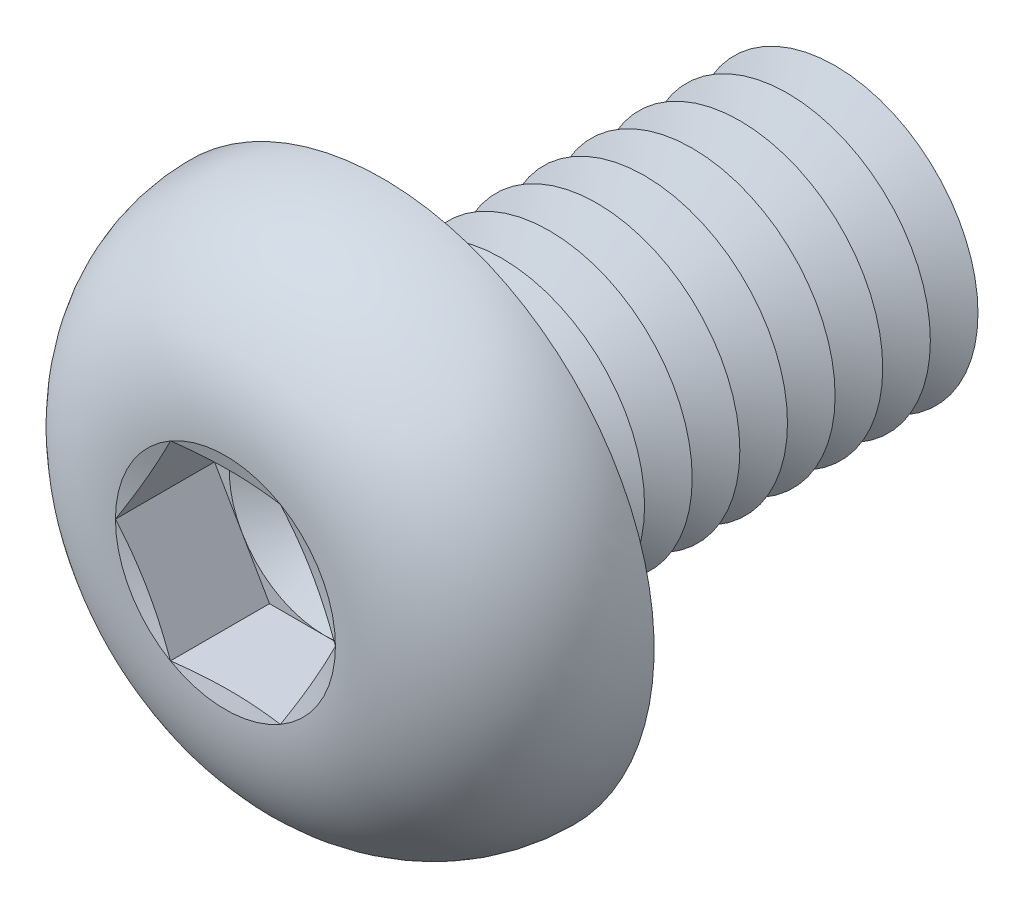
ISO-10303-21;
HEADER;
FILE_DESCRIPTION(('STEP AP214'),'2;1');
FILE_NAME('part.step','',(''),(''),'','','');
FILE_SCHEMA(('AUTOMOTIVE_DESIGN { 1 0 10303 214 1 1 1 1 }'));
ENDSEC;
DATA;
#1=APPLICATION_CONTEXT('core data for automotive mechanical design processes');
#2=APPLICATION_PROTOCOL_DEFINITION('international standard','automotive_design',2000,#1);
#3=PRODUCT_CONTEXT('',#1,'mechanical');
#4=PRODUCT('Part','Part','',(#3));
#5=PRODUCT_RELATED_PRODUCT_CATEGORY('part','',(#4));
#6=PRODUCT_DEFINITION_FORMATION('','',#4);
#7=PRODUCT_DEFINITION_CONTEXT('part definition',#1,'design');
#8=PRODUCT_DEFINITION('design','',#6,#7);
#9=PRODUCT_DEFINITION_SHAPE('','',#8);
#10=(LENGTH_UNIT() NAMED_UNIT(*) SI_UNIT(.MILLI.,.METRE.));
#11=(NAMED_UNIT(*) PLANE_ANGLE_UNIT() SI_UNIT($,.RADIAN.));
#12=(NAMED_UNIT(*) SI_UNIT($,.STERADIAN.) SOLID_ANGLE_UNIT());
#13=UNCERTAINTY_MEASURE_WITH_UNIT(LENGTH_MEASURE(1.E-05),#10,'distance_accuracy_value','');
#14=(GEOMETRIC_REPRESENTATION_CONTEXT(3) GLOBAL_UNCERTAINTY_ASSIGNED_CONTEXT((#13)) GLOBAL_UNIT_ASSIGNED_CONTEXT((#10,
#11,#12)) REPRESENTATION_CONTEXT('',''));
#15=CARTESIAN_POINT('',(0.,0.,0.));
#16=DIRECTION('',(0.,0.,1.));
#17=DIRECTION('',(1.,0.,0.));
#18=AXIS2_PLACEMENT_3D('',#15,#16,#17);
#19=CARTESIAN_POINT('',(0.,0.,0.609999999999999));
#20=DIRECTION('',(0.,0.,1.));
#21=DIRECTION('',(1.,0.,0.));
#22=AXIS2_PLACEMENT_3D('',#19,#20,#21);
#23=PLANE('',#22);
#24=CARTESIAN_POINT('',(0.,0.,0.609999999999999));
#25=DIRECTION('',(0.,0.,1.));
#26=DIRECTION('',(1.,0.,0.));
#27=AXIS2_PLACEMENT_3D('',#24,#25,#26);
#28=CIRCLE('',#27,0.999999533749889);
#29=CARTESIAN_POINT('',(0.866024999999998,0.499999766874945,0.609999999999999));
#30=VERTEX_POINT('',#29);
#31=CARTESIAN_POINT('',(0.,0.999999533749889,0.609999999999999));
#32=VERTEX_POINT('',#31);
#33=EDGE_CURVE('E118',#30,#32,#28,.T.);
#34=ORIENTED_EDGE('',*,*,#33,.F.);
#35=DIRECTION('',(-0.500000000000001,0.866025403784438,0.));
#36=VECTOR('',#35,1.);
#37=CARTESIAN_POINT('',(1.1547,0.,0.609999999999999));
#38=LINE('',#37,#36);
#39=CARTESIAN_POINT('',(0.577349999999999,0.999999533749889,0.609999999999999));
#40=VERTEX_POINT('',#39);
#41=EDGE_CURVE('E125',#30,#40,#38,.T.);
#42=ORIENTED_EDGE('',*,*,#41,.T.);
#43=DIRECTION('',(-1.,0.,0.));
#44=VECTOR('',#43,1.);
#45=CARTESIAN_POINT('',(0.577349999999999,0.999999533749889,0.609999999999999));
#46=LINE('',#45,#44);
#47=EDGE_CURVE('E136',#40,#32,#46,.T.);
#48=ORIENTED_EDGE('',*,*,#47,.T.);
#49=EDGE_LOOP('',(#34,#42,#48));
#50=FACE_BOUND('',#49,.T.);
#51=ADVANCED_FACE('F39',(#50),#23,.T.);
#52=CARTESIAN_POINT('',(0.,0.,0.609999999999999));
#53=DIRECTION('',(0.,0.,1.));
#54=DIRECTION('',(1.,0.,0.));
#55=AXIS2_PLACEMENT_3D('',#52,#53,#54);
#56=CIRCLE('',#55,0.999999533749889);
#57=CARTESIAN_POINT('',(-0.866024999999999,0.499999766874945,0.609999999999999));
#58=VERTEX_POINT('',#57);
#59=EDGE_CURVE('E11',#32,#58,#56,.T.);
#60=ORIENTED_EDGE('',*,*,#59,.F.);
#61=CARTESIAN_POINT('',(-0.577350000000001,0.999999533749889,0.609999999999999));
#62=VERTEX_POINT('',#61);
#63=EDGE_CURVE('E131',#32,#62,#46,.T.);
#64=ORIENTED_EDGE('',*,*,#63,.T.);
#65=DIRECTION('',(-0.5,-0.866025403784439,0.));
#66=VECTOR('',#65,1.);
#67=CARTESIAN_POINT('',(-0.577350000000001,0.999999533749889,0.609999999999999));
#68=LINE('',#67,#66);
#69=EDGE_CURVE('E134',#62,#58,#68,.T.);
#70=ORIENTED_EDGE('',*,*,#69,.T.);
#71=EDGE_LOOP('',(#60,#64,#70));
#72=FACE_BOUND('',#71,.T.);
#73=ADVANCED_FACE('F130',(#72),#23,.T.);
#74=CARTESIAN_POINT('',(-0.866024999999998,-0.499999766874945,0.609999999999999));
#75=VERTEX_POINT('',#74);
#76=EDGE_CURVE('E49',#58,#75,#56,.T.);
#77=ORIENTED_EDGE('',*,*,#76,.F.);
#78=CARTESIAN_POINT('',(-1.1547,0.,0.609999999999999));
#79=VERTEX_POINT('',#78);
#80=EDGE_CURVE('E143',#58,#79,#68,.T.);
#81=ORIENTED_EDGE('',*,*,#80,.T.);
#82=DIRECTION('',(0.5,-0.866025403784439,0.));
#83=VECTOR('',#82,1.);
#84=CARTESIAN_POINT('',(-1.1547,0.,0.609999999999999));
#85=LINE('',#84,#83);
#86=EDGE_CURVE('E152',#79,#75,#85,.T.);
#87=ORIENTED_EDGE('',*,*,#86,.T.);
#88=EDGE_LOOP('',(#77,#81,#87));
#89=FACE_BOUND('',#88,.T.);
#90=ADVANCED_FACE('F347',(#89),#23,.T.);
#91=CARTESIAN_POINT('',(0.,-0.999999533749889,0.609999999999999));
#92=VERTEX_POINT('',#91);
#93=EDGE_CURVE('E332',#75,#92,#56,.T.);
#94=ORIENTED_EDGE('',*,*,#93,.F.);
#95=CARTESIAN_POINT('',(-0.577349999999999,-0.99999953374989,0.609999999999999));
#96=VERTEX_POINT('',#95);
#97=EDGE_CURVE('E151',#75,#96,#85,.T.);
#98=ORIENTED_EDGE('',*,*,#97,.T.);
#99=DIRECTION('',(1.,0.,0.));
#100=VECTOR('',#99,1.);
#101=CARTESIAN_POINT('',(-0.577349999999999,-0.99999953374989,0.609999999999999));
#102=LINE('',#101,#100);
#103=EDGE_CURVE('E157',#96,#92,#102,.T.);
#104=ORIENTED_EDGE('',*,*,#103,.T.);
#105=EDGE_LOOP('',(#94,#98,#104));
#106=FACE_BOUND('',#105,.T.);
#107=ADVANCED_FACE('F340',(#106),#23,.T.);
#108=CARTESIAN_POINT('',(0.866024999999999,-0.499999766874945,0.609999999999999));
#109=VERTEX_POINT('',#108);
#110=EDGE_CURVE('E56',#92,#109,#56,.T.);
#111=ORIENTED_EDGE('',*,*,#110,.F.);
#112=CARTESIAN_POINT('',(0.577349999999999,-0.99999953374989,0.609999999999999));
#113=VERTEX_POINT('',#112);
#114=EDGE_CURVE('E156',#92,#113,#102,.T.);
#115=ORIENTED_EDGE('',*,*,#114,.T.);
#116=DIRECTION('',(0.5,0.866025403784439,0.));
#117=VECTOR('',#116,1.);
#118=CARTESIAN_POINT('',(0.577349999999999,-0.99999953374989,0.609999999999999));
#119=LINE('',#118,#117);
#120=EDGE_CURVE('E162',#113,#109,#119,.T.);
#121=ORIENTED_EDGE('',*,*,#120,.T.);
#122=EDGE_LOOP('',(#111,#115,#121));
#123=FACE_BOUND('',#122,.T.);
#124=ADVANCED_FACE('F389',(#123),#23,.T.);
#125=CARTESIAN_POINT('',(0.,0.,1.65));
#126=DIRECTION('',(0.,0.,1.));
#127=DIRECTION('',(1.,0.,0.));
#128=AXIS2_PLACEMENT_3D('',#125,#126,#127);
#129=CONICAL_SURFACE('',#128,1.1547,1.30899693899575);
#130=CARTESIAN_POINT('',(1.15481547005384,-0.000199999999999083,1.65003094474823));
#131=CARTESIAN_POINT('',(1.13083002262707,0.0413440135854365,1.64359970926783));
#132=CARTESIAN_POINT('',(1.10680107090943,0.0829633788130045,1.63776108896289));
#133=CARTESIAN_POINT('',(1.05865826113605,0.166349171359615,1.62750303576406));
#134=CARTESIAN_POINT('',(1.03454437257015,0.208115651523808,1.62308418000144));
#135=CARTESIAN_POINT('',(0.986377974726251,0.291542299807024,1.61592375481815));
#136=CARTESIAN_POINT('',(0.962325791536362,0.333201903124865,1.61317364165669));
#137=CARTESIAN_POINT('',(0.914190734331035,0.416574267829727,1.60948600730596));
#138=CARTESIAN_POINT('',(0.890107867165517,0.458287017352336,1.60854813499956));
#139=CARTESIAN_POINT('',(0.841942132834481,0.541712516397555,1.60854813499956));
#140=CARTESIAN_POINT('',(0.817859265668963,0.583425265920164,1.60948600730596));
#141=CARTESIAN_POINT('',(0.769724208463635,0.666797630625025,1.61317364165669));
#142=CARTESIAN_POINT('',(0.745672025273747,0.708457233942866,1.61592375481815));
#143=CARTESIAN_POINT('',(0.697505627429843,0.791883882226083,1.62308418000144));
#144=CARTESIAN_POINT('',(0.673391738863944,0.833650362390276,1.62750303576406));
#145=CARTESIAN_POINT('',(0.625248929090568,0.917036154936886,1.63776108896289));
#146=CARTESIAN_POINT('',(0.60121997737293,0.958655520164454,1.64359970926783));
#147=CARTESIAN_POINT('',(0.577234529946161,1.00019953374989,1.65003094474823));
#148=B_SPLINE_CURVE_WITH_KNOTS('',3,(#130,#131,#132,#133,#134,#135,#136,#137,#138,#139,#140,
#141,#142,#143,#144,#145,#146,#147),.UNSPECIFIED.,.F.,.F.,(4,2,2,2,2,2,2,2,4),(0.,
0.145207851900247,0.290474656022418,0.434991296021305,0.579479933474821,0.723968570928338,
0.868485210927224,1.0137520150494,1.15895986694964),.UNSPECIFIED.);
#149=CARTESIAN_POINT('',(1.1547,0.,1.65));
#150=VERTEX_POINT('',#149);
#151=CARTESIAN_POINT('',(0.57735,0.99999953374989,1.65));
#152=VERTEX_POINT('',#151);
#153=EDGE_CURVE('E221',#150,#152,#148,.T.);
#154=ORIENTED_EDGE('',*,*,#153,.F.);
#155=CARTESIAN_POINT('',(0.,0.,1.65));
#156=DIRECTION('',(0.,0.,-1.));
#157=DIRECTION('',(-1.,0.,0.));
#158=AXIS2_PLACEMENT_3D('',#155,#156,#157);
#159=CIRCLE('',#158,1.1547);
#160=EDGE_CURVE('E377',#152,#150,#159,.T.);
#161=ORIENTED_EDGE('',*,*,#160,.F.);
#162=EDGE_LOOP('',(#154,#161));
#163=FACE_BOUND('',#162,.T.);
#164=ADVANCED_FACE('F405',(#163),#129,.F.);
#165=CARTESIAN_POINT('',(0.577234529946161,-1.00019953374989,1.65003094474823));
#166=CARTESIAN_POINT('',(0.60121997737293,-0.958655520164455,1.64359970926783));
#167=CARTESIAN_POINT('',(0.625248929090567,-0.917036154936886,1.63776108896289));
#168=CARTESIAN_POINT('',(0.673391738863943,-0.833650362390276,1.62750303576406));
#169=CARTESIAN_POINT('',(0.697505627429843,-0.791883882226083,1.62308418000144));
#170=CARTESIAN_POINT('',(0.745672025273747,-0.708457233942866,1.61592375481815));
#171=CARTESIAN_POINT('',(0.769724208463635,-0.666797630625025,1.61317364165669));
#172=CARTESIAN_POINT('',(0.817859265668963,-0.583425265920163,1.60948600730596));
#173=CARTESIAN_POINT('',(0.841942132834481,-0.541712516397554,1.60854813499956));
#174=CARTESIAN_POINT('',(0.890107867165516,-0.458287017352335,1.60854813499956));
#175=CARTESIAN_POINT('',(0.914190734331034,-0.416574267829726,1.60948600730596));
#176=CARTESIAN_POINT('',(0.962325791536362,-0.333201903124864,1.61317364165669));
#177=CARTESIAN_POINT('',(0.986377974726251,-0.291542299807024,1.61592375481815));
#178=CARTESIAN_POINT('',(1.03454437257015,-0.208115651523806,1.62308418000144));
#179=CARTESIAN_POINT('',(1.05865826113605,-0.166349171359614,1.62750303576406));
#180=CARTESIAN_POINT('',(1.10680107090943,-0.0829633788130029,1.63776108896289));
#181=CARTESIAN_POINT('',(1.13083002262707,-0.0413440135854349,1.64359970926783));
#182=CARTESIAN_POINT('',(1.15481547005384,0.00020000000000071,1.65003094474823));
#183=B_SPLINE_CURVE_WITH_KNOTS('',3,(#165,#166,#167,#168,#169,#170,#171,#172,#173,#174,#175,
#176,#177,#178,#179,#180,#181,#182),.UNSPECIFIED.,.F.,.F.,(4,2,2,2,2,2,2,2,4),(0.,
0.145207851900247,0.290474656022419,0.434991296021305,0.579479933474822,0.723968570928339,
0.868485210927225,1.0137520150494,1.15895986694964),.UNSPECIFIED.);
#184=CARTESIAN_POINT('',(0.577349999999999,-0.99999953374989,1.65));
#185=VERTEX_POINT('',#184);
#186=EDGE_CURVE('E230',#185,#150,#183,.T.);
#187=ORIENTED_EDGE('',*,*,#186,.F.);
#188=EDGE_CURVE('E379',#150,#185,#159,.T.);
#189=ORIENTED_EDGE('',*,*,#188,.F.);
#190=EDGE_LOOP('',(#187,#189));
#191=FACE_BOUND('',#190,.T.);
#192=ADVANCED_FACE('F407',(#191),#129,.F.);
#193=CARTESIAN_POINT('',(-1.7425668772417,-0.99999953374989,1.87893949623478));
#194=CARTESIAN_POINT('',(-1.65819693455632,-0.99999953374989,1.85935934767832));
#195=CARTESIAN_POINT('',(-1.57375647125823,-0.99999953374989,1.84006351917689));
#196=CARTESIAN_POINT('',(-1.40464514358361,-0.99999953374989,1.80242908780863));
#197=CARTESIAN_POINT('',(-1.31997423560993,-0.99999953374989,1.78409068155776));
#198=CARTESIAN_POINT('',(-1.14955192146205,-0.99999953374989,1.74860242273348));
#199=CARTESIAN_POINT('',(-1.06379782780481,-0.99999953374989,1.73146532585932));
#200=CARTESIAN_POINT('',(-0.891887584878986,-0.99999953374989,1.69925819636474));
#201=CARTESIAN_POINT('',(-0.805731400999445,-0.99999953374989,1.68418834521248));
#202=CARTESIAN_POINT('',(-0.635256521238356,-0.99999953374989,1.65751615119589));
#203=CARTESIAN_POINT('',(-0.550951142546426,-0.99999953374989,1.64583105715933));
#204=CARTESIAN_POINT('',(-0.381865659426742,-0.99999953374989,1.62668811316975));
#205=CARTESIAN_POINT('',(-0.297085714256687,-0.99999953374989,1.61922892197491));
#206=CARTESIAN_POINT('',(-0.127577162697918,-0.99999953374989,1.60981453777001));
#207=CARTESIAN_POINT('',(-0.0428499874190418,-0.99999953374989,1.60783514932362));
#208=CARTESIAN_POINT('',(0.126542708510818,-0.99999953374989,1.60973012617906));
#209=CARTESIAN_POINT('',(0.211208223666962,-0.99999953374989,1.61360496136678));
#210=CARTESIAN_POINT('',(0.356115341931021,-0.99999953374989,1.62460226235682));
#211=CARTESIAN_POINT('',(0.416458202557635,-0.99999953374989,1.63048841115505));
#212=CARTESIAN_POINT('',(0.536893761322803,-0.99999953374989,1.64437752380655));
#213=CARTESIAN_POINT('',(0.596986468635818,-0.99999953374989,1.65238040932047));
#214=CARTESIAN_POINT('',(0.777275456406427,-0.99999953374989,1.67888855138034));
#215=CARTESIAN_POINT('',(0.897104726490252,-0.99999953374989,1.69985858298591));
#216=CARTESIAN_POINT('',(1.07751611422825,-0.99999953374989,1.73433574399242));
#217=CARTESIAN_POINT('',(1.1383777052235,-0.99999953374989,1.74646914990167));
#218=CARTESIAN_POINT('',(1.25994955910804,-0.99999953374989,1.7714845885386));
#219=CARTESIAN_POINT('',(1.32065982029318,-0.99999953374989,1.7843666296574));
#220=CARTESIAN_POINT('',(1.44162663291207,-0.99999953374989,1.81062164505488));
#221=CARTESIAN_POINT('',(1.50188385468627,-0.99999953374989,1.82399156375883));
#222=CARTESIAN_POINT('',(1.62229550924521,-0.99999953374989,1.85116781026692));
#223=CARTESIAN_POINT('',(1.68244994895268,-0.99999953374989,1.86497410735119));
#224=CARTESIAN_POINT('',(1.7425668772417,-0.99999953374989,1.87893949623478));
#225=B_SPLINE_CURVE_WITH_KNOTS('',3,(#193,#194,#195,#196,#197,#198,#199,#200,#201,#202,#203,
#204,#205,#206,#207,#208,#209,#210,#211,#212,#213,#214,#215,#216,#217,#218,#219,#220,#221,#222,
#223,#224),.UNSPECIFIED.,.F.,.F.,(4,2,2,2,2,2,2,2,2,2,2,2,2,2,2,4),(0.,0.259842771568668,
0.519738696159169,0.782071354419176,1.04442702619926,1.29968778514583,1.55486748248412,
1.80891865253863,2.06299021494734,2.24483732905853,2.42667771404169,2.79149503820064,
2.97767344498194,3.16385393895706,3.34902052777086,3.53417411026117),.UNSPECIFIED.);
#226=CARTESIAN_POINT('',(-0.577349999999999,-0.99999953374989,1.65));
#227=VERTEX_POINT('',#226);
#228=EDGE_CURVE('E359',#227,#185,#225,.T.);
#229=ORIENTED_EDGE('',*,*,#228,.F.);
#230=EDGE_CURVE('E367',#185,#227,#159,.T.);
#231=ORIENTED_EDGE('',*,*,#230,.F.);
#232=EDGE_LOOP('',(#229,#231));
#233=FACE_BOUND('',#232,.T.);
#234=ADVANCED_FACE('F409',(#233),#129,.F.);
#235=CARTESIAN_POINT('',(-1.15481547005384,0.000200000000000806,1.65003094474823));
#236=CARTESIAN_POINT('',(-1.13083002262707,-0.0413440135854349,1.64359970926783));
#237=CARTESIAN_POINT('',(-1.10680107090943,-0.082963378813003,1.63776108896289));
#238=CARTESIAN_POINT('',(-1.05865826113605,-0.166349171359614,1.62750303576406));
#239=CARTESIAN_POINT('',(-1.03454437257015,-0.208115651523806,1.62308418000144));
#240=CARTESIAN_POINT('',(-0.986377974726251,-0.291542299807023,1.61592375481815));
#241=CARTESIAN_POINT('',(-0.962325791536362,-0.333201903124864,1.61317364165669));
#242=CARTESIAN_POINT('',(-0.914190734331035,-0.416574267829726,1.60948600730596));
#243=CARTESIAN_POINT('',(-0.890107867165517,-0.458287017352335,1.60854813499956));
#244=CARTESIAN_POINT('',(-0.841942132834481,-0.541712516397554,1.60854813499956));
#245=CARTESIAN_POINT('',(-0.817859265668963,-0.583425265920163,1.60948600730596));
#246=CARTESIAN_POINT('',(-0.769724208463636,-0.666797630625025,1.61317364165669));
#247=CARTESIAN_POINT('',(-0.745672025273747,-0.708457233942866,1.61592375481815));
#248=CARTESIAN_POINT('',(-0.697505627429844,-0.791883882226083,1.62308418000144));
#249=CARTESIAN_POINT('',(-0.673391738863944,-0.833650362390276,1.62750303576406));
#250=CARTESIAN_POINT('',(-0.625248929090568,-0.917036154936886,1.63776108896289));
#251=CARTESIAN_POINT('',(-0.60121997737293,-0.958655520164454,1.64359970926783));
#252=CARTESIAN_POINT('',(-0.577234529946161,-1.00019953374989,1.65003094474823));
#253=B_SPLINE_CURVE_WITH_KNOTS('',3,(#235,#236,#237,#238,#239,#240,#241,#242,#243,#244,#245,
#246,#247,#248,#249,#250,#251,#252),.UNSPECIFIED.,.F.,.F.,(4,2,2,2,2,2,2,2,4),(0.,
0.145207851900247,0.290474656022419,0.434991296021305,0.579479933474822,0.723968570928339,
0.868485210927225,1.0137520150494,1.15895986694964),.UNSPECIFIED.);
#254=CARTESIAN_POINT('',(-1.1547,0.,1.65));
#255=VERTEX_POINT('',#254);
#256=EDGE_CURVE('E352',#255,#227,#253,.T.);
#257=ORIENTED_EDGE('',*,*,#256,.F.);
#258=EDGE_CURVE('E315',#227,#255,#159,.T.);
#259=ORIENTED_EDGE('',*,*,#258,.F.);
#260=EDGE_LOOP('',(#257,#259));
#261=FACE_BOUND('',#260,.T.);
#262=ADVANCED_FACE('F356',(#261),#129,.F.);
#263=CARTESIAN_POINT('',(-0.577234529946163,1.00019953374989,1.65003094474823));
#264=CARTESIAN_POINT('',(-0.601219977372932,0.958655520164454,1.64359970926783));
#265=CARTESIAN_POINT('',(-0.625248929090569,0.917036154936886,1.63776108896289));
#266=CARTESIAN_POINT('',(-0.673391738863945,0.833650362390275,1.62750303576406));
#267=CARTESIAN_POINT('',(-0.697505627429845,0.791883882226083,1.62308418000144));
#268=CARTESIAN_POINT('',(-0.745672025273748,0.708457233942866,1.61592375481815));
#269=CARTESIAN_POINT('',(-0.769724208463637,0.666797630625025,1.61317364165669));
#270=CARTESIAN_POINT('',(-0.817859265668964,0.583425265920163,1.60948600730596));
#271=CARTESIAN_POINT('',(-0.841942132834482,0.541712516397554,1.60854813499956));
#272=CARTESIAN_POINT('',(-0.890107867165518,0.458287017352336,1.60854813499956));
#273=CARTESIAN_POINT('',(-0.914190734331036,0.416574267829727,1.60948600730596));
#274=CARTESIAN_POINT('',(-0.962325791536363,0.333201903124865,1.61317364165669));
#275=CARTESIAN_POINT('',(-0.986377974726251,0.291542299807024,1.61592375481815));
#276=CARTESIAN_POINT('',(-1.03454437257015,0.208115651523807,1.62308418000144));
#277=CARTESIAN_POINT('',(-1.05865826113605,0.166349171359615,1.62750303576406));
#278=CARTESIAN_POINT('',(-1.10680107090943,0.0829633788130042,1.63776108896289));
#279=CARTESIAN_POINT('',(-1.13083002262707,0.0413440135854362,1.64359970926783));
#280=CARTESIAN_POINT('',(-1.15481547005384,-0.000199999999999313,1.65003094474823));
#281=B_SPLINE_CURVE_WITH_KNOTS('',3,(#263,#264,#265,#266,#267,#268,#269,#270,#271,#272,#273,
#274,#275,#276,#277,#278,#279,#280),.UNSPECIFIED.,.F.,.F.,(4,2,2,2,2,2,2,2,4),(0.,
0.145207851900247,0.290474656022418,0.434991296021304,0.579479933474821,0.723968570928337,
0.868485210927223,1.01375201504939,1.15895986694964),.UNSPECIFIED.);
#282=CARTESIAN_POINT('',(-0.577350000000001,0.999999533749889,1.65));
#283=VERTEX_POINT('',#282);
#284=EDGE_CURVE('E195',#283,#255,#281,.T.);
#285=ORIENTED_EDGE('',*,*,#284,.F.);
#286=EDGE_CURVE('E316',#255,#283,#159,.T.);
#287=ORIENTED_EDGE('',*,*,#286,.F.);
#288=EDGE_LOOP('',(#285,#287));
#289=FACE_BOUND('',#288,.T.);
#290=ADVANCED_FACE('F370',(#289),#129,.F.);
#291=CARTESIAN_POINT('',(0.,0.,-3.25));
#292=DIRECTION('',(0.,0.,1.));
#293=DIRECTION('',(1.,0.,0.));
#294=AXIS2_PLACEMENT_3D('',#291,#292,#293);
#295=CONICAL_SURFACE('',#294,1.5,1.0471975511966);
#296=CARTESIAN_POINT('',(0.,0.,-3.5));
#297=DIRECTION('',(0.,0.,1.));
#298=DIRECTION('',(1.,0.,0.));
#299=AXIS2_PLACEMENT_3D('',#296,#297,#298);
#300=CIRCLE('',#299,1.06698729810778);
#301=CARTESIAN_POINT('',(1.06698729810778,0.,-3.5));
#302=VERTEX_POINT('',#301);
#303=EDGE_CURVE('E287',#302,#302,#300,.T.);
#304=ORIENTED_EDGE('',*,*,#303,.T.);
#305=EDGE_LOOP('',(#304));
#306=FACE_BOUND('',#305,.T.);
#307=CARTESIAN_POINT('',(0.,0.,-3.25));
#308=DIRECTION('',(0.,0.,1.));
#309=DIRECTION('',(1.,0.,0.));
#310=AXIS2_PLACEMENT_3D('',#307,#308,#309);
#311=CIRCLE('',#310,1.5);
#312=CARTESIAN_POINT('',(1.5,0.,-3.25));
#313=VERTEX_POINT('',#312);
#314=EDGE_CURVE('E283',#313,#313,#311,.T.);
#315=ORIENTED_EDGE('',*,*,#314,.F.);
#316=EDGE_LOOP('',(#315));
#317=FACE_BOUND('',#316,.T.);
#318=ADVANCED_FACE('F482',(#306,#317),#295,.T.);
#319=CARTESIAN_POINT('',(0.,0.,-3.5));
#320=DIRECTION('',(0.,0.,-1.));
#321=DIRECTION('',(-1.,0.,0.));
#322=AXIS2_PLACEMENT_3D('',#319,#320,#321);
#323=CONICAL_SURFACE('',#322,1.06698729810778,1.0471975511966);
#324=CARTESIAN_POINT('',(0.,0.,-3.75));
#325=DIRECTION('',(0.,0.,1.));
#326=DIRECTION('',(1.,0.,0.));
#327=AXIS2_PLACEMENT_3D('',#324,#325,#326);
#328=CIRCLE('',#327,1.5);
#329=CARTESIAN_POINT('',(1.5,0.,-3.75));
#330=VERTEX_POINT('',#329);
#331=EDGE_CURVE('E291',#330,#330,#328,.T.);
#332=ORIENTED_EDGE('',*,*,#331,.T.);
#333=EDGE_LOOP('',(#332));
#334=FACE_BOUND('',#333,.T.);
#335=ORIENTED_EDGE('',*,*,#303,.F.);
#336=EDGE_LOOP('',(#335));
#337=FACE_BOUND('',#336,.T.);
#338=ADVANCED_FACE('F673',(#334,#337),#323,.T.);
#339=CARTESIAN_POINT('',(0.,1.5,-5.));
#340=DIRECTION('',(0.,0.,-1.));
#341=DIRECTION('',(-1.,0.,0.));
#342=AXIS2_PLACEMENT_3D('',#339,#340,#341);
#343=PLANE('',#342);
#344=CARTESIAN_POINT('',(0.,0.,-5.));
#345=DIRECTION('',(0.,0.,1.));
#346=DIRECTION('',(1.,0.,0.));
#347=AXIS2_PLACEMENT_3D('',#344,#345,#346);
#348=CIRCLE('',#347,1.06698729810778);
#349=CARTESIAN_POINT('',(1.06698729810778,0.,-5.));
#350=VERTEX_POINT('',#349);
#351=EDGE_CURVE('E311',#350,#350,#348,.T.);
#352=ORIENTED_EDGE('',*,*,#351,.F.);
#353=EDGE_LOOP('',(#352));
#354=FACE_BOUND('',#353,.T.);
#355=ADVANCED_FACE('F678',(#354),#343,.T.);
#356=CARTESIAN_POINT('',(0.,0.,-4.75));
#357=DIRECTION('',(0.,0.,1.));
#358=DIRECTION('',(1.,0.,0.));
#359=AXIS2_PLACEMENT_3D('',#356,#357,#358);
#360=CONICAL_SURFACE('',#359,1.5,1.0471975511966);
#361=ORIENTED_EDGE('',*,*,#351,.T.);
#362=EDGE_LOOP('',(#361));
#363=FACE_BOUND('',#362,.T.);
#364=CARTESIAN_POINT('',(0.,0.,-4.75));
#365=DIRECTION('',(0.,0.,1.));
#366=DIRECTION('',(1.,0.,0.));
#367=AXIS2_PLACEMENT_3D('',#364,#365,#366);
#368=CIRCLE('',#367,1.5);
#369=CARTESIAN_POINT('',(1.5,0.,-4.75));
#370=VERTEX_POINT('',#369);
#371=EDGE_CURVE('E307',#370,#370,#368,.T.);
#372=ORIENTED_EDGE('',*,*,#371,.F.);
#373=EDGE_LOOP('',(#372));
#374=FACE_BOUND('',#373,.T.);
#375=ADVANCED_FACE('F666',(#363,#374),#360,.T.);
#376=CARTESIAN_POINT('',(0.,0.,-4.5));
#377=DIRECTION('',(0.,0.,-1.));
#378=DIRECTION('',(-1.,0.,0.));
#379=AXIS2_PLACEMENT_3D('',#376,#377,#378);
#380=CONICAL_SURFACE('',#379,1.06698729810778,1.0471975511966);
#381=ORIENTED_EDGE('',*,*,#371,.T.);
#382=EDGE_LOOP('',(#381));
#383=FACE_BOUND('',#382,.T.);
#384=CARTESIAN_POINT('',(0.,0.,-4.5));
#385=DIRECTION('',(0.,0.,1.));
#386=DIRECTION('',(1.,0.,0.));
#387=AXIS2_PLACEMENT_3D('',#384,#385,#386);
#388=CIRCLE('',#387,1.06698729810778);
#389=CARTESIAN_POINT('',(1.06698729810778,0.,-4.5));
#390=VERTEX_POINT('',#389);
#391=EDGE_CURVE('E303',#390,#390,#388,.T.);
#392=ORIENTED_EDGE('',*,*,#391,.F.);
#393=EDGE_LOOP('',(#392));
#394=FACE_BOUND('',#393,.T.);
#395=ADVANCED_FACE('F656',(#383,#394),#380,.T.);
#396=CARTESIAN_POINT('',(0.,0.,-4.25));
#397=DIRECTION('',(0.,0.,1.));
#398=DIRECTION('',(1.,0.,0.));
#399=AXIS2_PLACEMENT_3D('',#396,#397,#398);
#400=CONICAL_SURFACE('',#399,1.5,1.0471975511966);
#401=ORIENTED_EDGE('',*,*,#391,.T.);
#402=EDGE_LOOP('',(#401));
#403=FACE_BOUND('',#402,.T.);
#404=CARTESIAN_POINT('',(0.,0.,-4.25));
#405=DIRECTION('',(0.,0.,1.));
#406=DIRECTION('',(1.,0.,0.));
#407=AXIS2_PLACEMENT_3D('',#404,#405,#406);
#408=CIRCLE('',#407,1.5);
#409=CARTESIAN_POINT('',(1.5,0.,-4.25));
#410=VERTEX_POINT('',#409);
#411=EDGE_CURVE('E299',#410,#410,#408,.T.);
#412=ORIENTED_EDGE('',*,*,#411,.F.);
#413=EDGE_LOOP('',(#412));
#414=FACE_BOUND('',#413,.T.);
#415=ADVANCED_FACE('F646',(#403,#414),#400,.T.);
#416=CARTESIAN_POINT('',(0.,0.,-4.));
#417=DIRECTION('',(0.,0.,-1.));
#418=DIRECTION('',(-1.,0.,0.));
#419=AXIS2_PLACEMENT_3D('',#416,#417,#418);
#420=CONICAL_SURFACE('',#419,1.06698729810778,1.0471975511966);
#421=ORIENTED_EDGE('',*,*,#411,.T.);
#422=EDGE_LOOP('',(#421));
#423=FACE_BOUND('',#422,.T.);
#424=CARTESIAN_POINT('',(0.,0.,-4.));
#425=DIRECTION('',(0.,0.,1.));
#426=DIRECTION('',(1.,0.,0.));
#427=AXIS2_PLACEMENT_3D('',#424,#425,#426);
#428=CIRCLE('',#427,1.06698729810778);
#429=CARTESIAN_POINT('',(1.06698729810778,0.,-4.));
#430=VERTEX_POINT('',#429);
#431=EDGE_CURVE('E295',#430,#430,#428,.T.);
#432=ORIENTED_EDGE('',*,*,#431,.F.);
#433=EDGE_LOOP('',(#432));
#434=FACE_BOUND('',#433,.T.);
#435=ADVANCED_FACE('F636',(#423,#434),#420,.T.);
#436=CARTESIAN_POINT('',(0.,0.,-3.75));
#437=DIRECTION('',(0.,0.,1.));
#438=DIRECTION('',(1.,0.,0.));
#439=AXIS2_PLACEMENT_3D('',#436,#437,#438);
#440=CONICAL_SURFACE('',#439,1.5,1.0471975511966);
#441=ORIENTED_EDGE('',*,*,#431,.T.);
#442=EDGE_LOOP('',(#441));
#443=FACE_BOUND('',#442,.T.);
#444=ORIENTED_EDGE('',*,*,#331,.F.);
#445=EDGE_LOOP('',(#444));
#446=FACE_BOUND('',#445,.T.);
#447=ADVANCED_FACE('F626',(#443,#446),#440,.T.);
#448=CARTESIAN_POINT('',(0.,0.,-2.75));
#449=DIRECTION('',(0.,0.,1.));
#450=DIRECTION('',(1.,0.,0.));
#451=AXIS2_PLACEMENT_3D('',#448,#449,#450);
#452=CONICAL_SURFACE('',#451,1.5,1.0471975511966);
#453=CARTESIAN_POINT('',(0.,0.,-3.));
#454=DIRECTION('',(0.,0.,1.));
#455=DIRECTION('',(1.,0.,0.));
#456=AXIS2_PLACEMENT_3D('',#453,#454,#455);
#457=CIRCLE('',#456,1.06698729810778);
#458=CARTESIAN_POINT('',(1.06698729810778,0.,-3.));
#459=VERTEX_POINT('',#458);
#460=EDGE_CURVE('E279',#459,#459,#457,.T.);
#461=ORIENTED_EDGE('',*,*,#460,.T.);
#462=EDGE_LOOP('',(#461));
#463=FACE_BOUND('',#462,.T.);
#464=CARTESIAN_POINT('',(0.,0.,-2.75));
#465=DIRECTION('',(0.,0.,1.));
#466=DIRECTION('',(1.,0.,0.));
#467=AXIS2_PLACEMENT_3D('',#464,#465,#466);
#468=CIRCLE('',#467,1.5);
#469=CARTESIAN_POINT('',(1.5,0.,-2.75));
#470=VERTEX_POINT('',#469);
#471=EDGE_CURVE('E275',#470,#470,#468,.T.);
#472=ORIENTED_EDGE('',*,*,#471,.F.);
#473=EDGE_LOOP('',(#472));
#474=FACE_BOUND('',#473,.T.);
#475=ADVANCED_FACE('F616',(#463,#474),#452,.T.);
#476=CARTESIAN_POINT('',(0.,0.,-3.));
#477=DIRECTION('',(0.,0.,-1.));
#478=DIRECTION('',(-1.,0.,0.));
#479=AXIS2_PLACEMENT_3D('',#476,#477,#478);
#480=CONICAL_SURFACE('',#479,1.06698729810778,1.0471975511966);
#481=ORIENTED_EDGE('',*,*,#314,.T.);
#482=EDGE_LOOP('',(#481));
#483=FACE_BOUND('',#482,.T.);
#484=ORIENTED_EDGE('',*,*,#460,.F.);
#485=EDGE_LOOP('',(#484));
#486=FACE_BOUND('',#485,.T.);
#487=ADVANCED_FACE('F606',(#483,#486),#480,.T.);
#488=CARTESIAN_POINT('',(0.,0.,-2.25));
#489=DIRECTION('',(0.,0.,1.));
#490=DIRECTION('',(1.,0.,0.));
#491=AXIS2_PLACEMENT_3D('',#488,#489,#490);
#492=CONICAL_SURFACE('',#491,1.5,1.0471975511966);
#493=CARTESIAN_POINT('',(0.,0.,-2.5));
#494=DIRECTION('',(0.,0.,1.));
#495=DIRECTION('',(1.,0.,0.));
#496=AXIS2_PLACEMENT_3D('',#493,#494,#495);
#497=CIRCLE('',#496,1.06698729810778);
#498=CARTESIAN_POINT('',(1.06698729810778,0.,-2.5));
#499=VERTEX_POINT('',#498);
#500=EDGE_CURVE('E271',#499,#499,#497,.T.);
#501=ORIENTED_EDGE('',*,*,#500,.T.);
#502=EDGE_LOOP('',(#501));
#503=FACE_BOUND('',#502,.T.);
#504=CARTESIAN_POINT('',(0.,0.,-2.25));
#505=DIRECTION('',(0.,0.,1.));
#506=DIRECTION('',(1.,0.,0.));
#507=AXIS2_PLACEMENT_3D('',#504,#505,#506);
#508=CIRCLE('',#507,1.5);
#509=CARTESIAN_POINT('',(1.5,0.,-2.25));
#510=VERTEX_POINT('',#509);
#511=EDGE_CURVE('E267',#510,#510,#508,.T.);
#512=ORIENTED_EDGE('',*,*,#511,.F.);
#513=EDGE_LOOP('',(#512));
#514=FACE_BOUND('',#513,.T.);
#515=ADVANCED_FACE('F596',(#503,#514),#492,.T.);
#516=CARTESIAN_POINT('',(0.,0.,-2.5));
#517=DIRECTION('',(0.,0.,-1.));
#518=DIRECTION('',(-1.,0.,0.));
#519=AXIS2_PLACEMENT_3D('',#516,#517,#518);
#520=CONICAL_SURFACE('',#519,1.06698729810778,1.0471975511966);
#521=ORIENTED_EDGE('',*,*,#471,.T.);
#522=EDGE_LOOP('',(#521));
#523=FACE_BOUND('',#522,.T.);
#524=ORIENTED_EDGE('',*,*,#500,.F.);
#525=EDGE_LOOP('',(#524));
#526=FACE_BOUND('',#525,.T.);
#527=ADVANCED_FACE('F586',(#523,#526),#520,.T.);
#528=CARTESIAN_POINT('',(0.,0.,-1.75));
#529=DIRECTION('',(0.,0.,1.));
#530=DIRECTION('',(1.,0.,0.));
#531=AXIS2_PLACEMENT_3D('',#528,#529,#530);
#532=CONICAL_SURFACE('',#531,1.5,1.0471975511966);
#533=CARTESIAN_POINT('',(0.,0.,-2.));
#534=DIRECTION('',(0.,0.,1.));
#535=DIRECTION('',(1.,0.,0.));
#536=AXIS2_PLACEMENT_3D('',#533,#534,#535);
#537=CIRCLE('',#536,1.06698729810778);
#538=CARTESIAN_POINT('',(1.06698729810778,0.,-2.));
#539=VERTEX_POINT('',#538);
#540=EDGE_CURVE('E264',#539,#539,#537,.T.);
#541=ORIENTED_EDGE('',*,*,#540,.T.);
#542=EDGE_LOOP('',(#541));
#543=FACE_BOUND('',#542,.T.);
#544=CARTESIAN_POINT('',(0.,0.,-1.75));
#545=DIRECTION('',(0.,0.,1.));
#546=DIRECTION('',(1.,0.,0.));
#547=AXIS2_PLACEMENT_3D('',#544,#545,#546);
#548=CIRCLE('',#547,1.5);
#549=CARTESIAN_POINT('',(1.5,0.,-1.75));
#550=VERTEX_POINT('',#549);
#551=EDGE_CURVE('E260',#550,#550,#548,.T.);
#552=ORIENTED_EDGE('',*,*,#551,.F.);
#553=EDGE_LOOP('',(#552));
#554=FACE_BOUND('',#553,.T.);
#555=ADVANCED_FACE('F576',(#543,#554),#532,.T.);
#556=CARTESIAN_POINT('',(0.,0.,-2.));
#557=DIRECTION('',(0.,0.,-1.));
#558=DIRECTION('',(-1.,0.,0.));
#559=AXIS2_PLACEMENT_3D('',#556,#557,#558);
#560=CONICAL_SURFACE('',#559,1.06698729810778,1.0471975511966);
#561=ORIENTED_EDGE('',*,*,#511,.T.);
#562=EDGE_LOOP('',(#561));
#563=FACE_BOUND('',#562,.T.);
#564=ORIENTED_EDGE('',*,*,#540,.F.);
#565=EDGE_LOOP('',(#564));
#566=FACE_BOUND('',#565,.T.);
#567=ADVANCED_FACE('F566',(#563,#566),#560,.T.);
#568=CARTESIAN_POINT('',(0.,0.,-1.25));
#569=DIRECTION('',(0.,0.,1.));
#570=DIRECTION('',(1.,0.,0.));
#571=AXIS2_PLACEMENT_3D('',#568,#569,#570);
#572=CONICAL_SURFACE('',#571,1.5,1.0471975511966);
#573=CARTESIAN_POINT('',(0.,0.,-1.5));
#574=DIRECTION('',(0.,0.,1.));
#575=DIRECTION('',(1.,0.,0.));
#576=AXIS2_PLACEMENT_3D('',#573,#574,#575);
#577=CIRCLE('',#576,1.06698729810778);
#578=CARTESIAN_POINT('',(1.06698729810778,0.,-1.5));
#579=VERTEX_POINT('',#578);
#580=EDGE_CURVE('E256',#579,#579,#577,.T.);
#581=ORIENTED_EDGE('',*,*,#580,.T.);
#582=EDGE_LOOP('',(#581));
#583=FACE_BOUND('',#582,.T.);
#584=CARTESIAN_POINT('',(0.,0.,-1.25));
#585=DIRECTION('',(0.,0.,1.));
#586=DIRECTION('',(1.,0.,0.));
#587=AXIS2_PLACEMENT_3D('',#584,#585,#586);
#588=CIRCLE('',#587,1.5);
#589=CARTESIAN_POINT('',(1.5,0.,-1.25));
#590=VERTEX_POINT('',#589);
#591=EDGE_CURVE('E252',#590,#590,#588,.T.);
#592=ORIENTED_EDGE('',*,*,#591,.F.);
#593=EDGE_LOOP('',(#592));
#594=FACE_BOUND('',#593,.T.);
#595=ADVANCED_FACE('F556',(#583,#594),#572,.T.);
#596=CARTESIAN_POINT('',(0.,0.,-1.5));
#597=DIRECTION('',(0.,0.,-1.));
#598=DIRECTION('',(-1.,0.,0.));
#599=AXIS2_PLACEMENT_3D('',#596,#597,#598);
#600=CONICAL_SURFACE('',#599,1.06698729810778,1.0471975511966);
#601=ORIENTED_EDGE('',*,*,#551,.T.);
#602=EDGE_LOOP('',(#601));
#603=FACE_BOUND('',#602,.T.);
#604=ORIENTED_EDGE('',*,*,#580,.F.);
#605=EDGE_LOOP('',(#604));
#606=FACE_BOUND('',#605,.T.);
#607=ADVANCED_FACE('F546',(#603,#606),#600,.T.);
#608=CARTESIAN_POINT('',(0.,0.,-0.75));
#609=DIRECTION('',(0.,0.,1.));
#610=DIRECTION('',(1.,0.,0.));
#611=AXIS2_PLACEMENT_3D('',#608,#609,#610);
#612=CONICAL_SURFACE('',#611,1.5,1.0471975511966);
#613=CARTESIAN_POINT('',(0.,0.,-1.));
#614=DIRECTION('',(0.,0.,1.));
#615=DIRECTION('',(1.,0.,0.));
#616=AXIS2_PLACEMENT_3D('',#613,#614,#615);
#617=CIRCLE('',#616,1.06698729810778);
#618=CARTESIAN_POINT('',(1.06698729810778,0.,-1.));
#619=VERTEX_POINT('',#618);
#620=EDGE_CURVE('E248',#619,#619,#617,.T.);
#621=ORIENTED_EDGE('',*,*,#620,.T.);
#622=EDGE_LOOP('',(#621));
#623=FACE_BOUND('',#622,.T.);
#624=CARTESIAN_POINT('',(0.,0.,-0.75));
#625=DIRECTION('',(0.,0.,1.));
#626=DIRECTION('',(1.,0.,0.));
#627=AXIS2_PLACEMENT_3D('',#624,#625,#626);
#628=CIRCLE('',#627,1.5);
#629=CARTESIAN_POINT('',(1.5,0.,-0.75));
#630=VERTEX_POINT('',#629);
#631=EDGE_CURVE('E240',#630,#630,#628,.T.);
#632=ORIENTED_EDGE('',*,*,#631,.F.);
#633=EDGE_LOOP('',(#632));
#634=FACE_BOUND('',#633,.T.);
#635=ADVANCED_FACE('F536',(#623,#634),#612,.T.);
#636=CARTESIAN_POINT('',(0.,0.,-1.));
#637=DIRECTION('',(0.,0.,-1.));
#638=DIRECTION('',(-1.,0.,0.));
#639=AXIS2_PLACEMENT_3D('',#636,#637,#638);
#640=CONICAL_SURFACE('',#639,1.06698729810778,1.0471975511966);
#641=ORIENTED_EDGE('',*,*,#591,.T.);
#642=EDGE_LOOP('',(#641));
#643=FACE_BOUND('',#642,.T.);
#644=ORIENTED_EDGE('',*,*,#620,.F.);
#645=EDGE_LOOP('',(#644));
#646=FACE_BOUND('',#645,.T.);
#647=ADVANCED_FACE('F527',(#643,#646),#640,.T.);
#648=CARTESIAN_POINT('',(0.,0.,-0.249999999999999));
#649=DIRECTION('',(0.,0.,1.));
#650=DIRECTION('',(1.,0.,0.));
#651=AXIS2_PLACEMENT_3D('',#648,#649,#650);
#652=CONICAL_SURFACE('',#651,1.5,1.0471975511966);
#653=CARTESIAN_POINT('',(0.,0.,-0.5));
#654=DIRECTION('',(0.,0.,1.));
#655=DIRECTION('',(1.,0.,0.));
#656=AXIS2_PLACEMENT_3D('',#653,#654,#655);
#657=CIRCLE('',#656,1.06698729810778);
#658=CARTESIAN_POINT('',(1.06698729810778,0.,-0.5));
#659=VERTEX_POINT('',#658);
#660=EDGE_CURVE('E229',#659,#659,#657,.T.);
#661=ORIENTED_EDGE('',*,*,#660,.T.);
#662=EDGE_LOOP('',(#661));
#663=FACE_BOUND('',#662,.T.);
#664=CARTESIAN_POINT('',(0.,0.,-0.249999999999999));
#665=DIRECTION('',(0.,0.,1.));
#666=DIRECTION('',(1.,0.,0.));
#667=AXIS2_PLACEMENT_3D('',#664,#665,#666);
#668=CIRCLE('',#667,1.5);
#669=CARTESIAN_POINT('',(1.5,0.,-0.249999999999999));
#670=VERTEX_POINT('',#669);
#671=EDGE_CURVE('E244',#670,#670,#668,.T.);
#672=ORIENTED_EDGE('',*,*,#671,.F.);
#673=EDGE_LOOP('',(#672));
#674=FACE_BOUND('',#673,.T.);
#675=ADVANCED_FACE('F518',(#663,#674),#652,.T.);
#676=CARTESIAN_POINT('',(0.,0.,-0.5));
#677=DIRECTION('',(0.,0.,-1.));
#678=DIRECTION('',(-1.,0.,0.));
#679=AXIS2_PLACEMENT_3D('',#676,#677,#678);
#680=CONICAL_SURFACE('',#679,1.06698729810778,1.0471975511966);
#681=ORIENTED_EDGE('',*,*,#631,.T.);
#682=EDGE_LOOP('',(#681));
#683=FACE_BOUND('',#682,.T.);
#684=ORIENTED_EDGE('',*,*,#660,.F.);
#685=EDGE_LOOP('',(#684));
#686=FACE_BOUND('',#685,.T.);
#687=ADVANCED_FACE('F218',(#683,#686),#680,.T.);
#688=CARTESIAN_POINT('',(1.7425668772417,0.999999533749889,1.87893949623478));
#689=CARTESIAN_POINT('',(1.65819693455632,0.999999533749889,1.85935934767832));
#690=CARTESIAN_POINT('',(1.57375647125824,0.999999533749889,1.84006351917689));
#691=CARTESIAN_POINT('',(1.40464514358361,0.999999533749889,1.80242908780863));
#692=CARTESIAN_POINT('',(1.31997423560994,0.999999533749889,1.78409068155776));
#693=CARTESIAN_POINT('',(1.14955192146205,0.999999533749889,1.74860242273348));
#694=CARTESIAN_POINT('',(1.06379782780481,0.999999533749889,1.73146532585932));
#695=CARTESIAN_POINT('',(0.891887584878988,0.999999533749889,1.69925819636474));
#696=CARTESIAN_POINT('',(0.805731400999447,0.999999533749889,1.68418834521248));
#697=CARTESIAN_POINT('',(0.635256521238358,0.999999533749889,1.65751615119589));
#698=CARTESIAN_POINT('',(0.550951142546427,0.999999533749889,1.64583105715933));
#699=CARTESIAN_POINT('',(0.381865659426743,0.999999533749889,1.62668811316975));
#700=CARTESIAN_POINT('',(0.297085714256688,0.999999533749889,1.61922892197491));
#701=CARTESIAN_POINT('',(0.127577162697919,0.999999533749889,1.60981453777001));
#702=CARTESIAN_POINT('',(0.0428499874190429,0.999999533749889,1.60783514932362));
#703=CARTESIAN_POINT('',(-0.126542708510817,0.999999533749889,1.60973012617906));
#704=CARTESIAN_POINT('',(-0.211208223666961,0.999999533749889,1.61360496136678));
#705=CARTESIAN_POINT('',(-0.35611534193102,0.999999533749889,1.62460226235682));
#706=CARTESIAN_POINT('',(-0.416458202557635,0.999999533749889,1.63048841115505));
#707=CARTESIAN_POINT('',(-0.536893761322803,0.999999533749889,1.64437752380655));
#708=CARTESIAN_POINT('',(-0.596986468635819,0.999999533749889,1.65238040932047));
#709=CARTESIAN_POINT('',(-0.777275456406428,0.999999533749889,1.67888855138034));
#710=CARTESIAN_POINT('',(-0.897104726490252,0.999999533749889,1.69985858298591));
#711=CARTESIAN_POINT('',(-1.07751611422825,0.999999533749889,1.73433574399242));
#712=CARTESIAN_POINT('',(-1.1383777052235,0.999999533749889,1.74646914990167));
#713=CARTESIAN_POINT('',(-1.25994955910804,0.999999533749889,1.7714845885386));
#714=CARTESIAN_POINT('',(-1.32065982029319,0.999999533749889,1.7843666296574));
#715=CARTESIAN_POINT('',(-1.44162663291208,0.999999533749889,1.81062164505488));
#716=CARTESIAN_POINT('',(-1.50188385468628,0.999999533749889,1.82399156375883));
#717=CARTESIAN_POINT('',(-1.62229550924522,0.999999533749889,1.85116781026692));
#718=CARTESIAN_POINT('',(-1.68244994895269,0.999999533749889,1.86497410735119));
#719=CARTESIAN_POINT('',(-1.7425668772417,0.999999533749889,1.87893949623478));
#720=B_SPLINE_CURVE_WITH_KNOTS('',3,(#688,#689,#690,#691,#692,#693,#694,#695,#696,#697,#698,
#699,#700,#701,#702,#703,#704,#705,#706,#707,#708,#709,#710,#711,#712,#713,#714,#715,#716,#717,
#718,#719),.UNSPECIFIED.,.F.,.F.,(4,2,2,2,2,2,2,2,2,2,2,2,2,2,2,4),(0.,0.259842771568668,
0.519738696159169,0.782071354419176,1.04442702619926,1.29968778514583,1.55486748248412,
1.80891865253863,2.06299021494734,2.24483732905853,2.42667771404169,2.79149503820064,
2.97767344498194,3.16385393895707,3.34902052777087,3.53417411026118),.UNSPECIFIED.);
#721=EDGE_CURVE('E170',#152,#283,#720,.T.);
#722=ORIENTED_EDGE('',*,*,#721,.F.);
#723=EDGE_CURVE('E321',#283,#152,#159,.T.);
#724=ORIENTED_EDGE('',*,*,#723,.F.);
#725=EDGE_LOOP('',(#722,#724));
#726=FACE_BOUND('',#725,.T.);
#727=ADVANCED_FACE('F202',(#726),#129,.F.);
#728=CARTESIAN_POINT('',(0.,0.,0.));
#729=DIRECTION('',(0.,0.,-1.));
#730=DIRECTION('',(-1.,0.,0.));
#731=AXIS2_PLACEMENT_3D('',#728,#729,#730);
#732=DEGENERATE_TOROIDAL_SURFACE('',#731,1.19939477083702,1.65060522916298,.T.);
#733=ORIENTED_EDGE('',*,*,#286,.T.);
#734=ORIENTED_EDGE('',*,*,#723,.T.);
#735=ORIENTED_EDGE('',*,*,#160,.T.);
#736=ORIENTED_EDGE('',*,*,#188,.T.);
#737=ORIENTED_EDGE('',*,*,#230,.T.);
#738=ORIENTED_EDGE('',*,*,#258,.T.);
#739=EDGE_LOOP('',(#733,#734,#735,#736,#737,#738));
#740=FACE_BOUND('',#739,.T.);
#741=CARTESIAN_POINT('',(0.,0.,0.));
#742=DIRECTION('',(0.,0.,-1.));
#743=DIRECTION('',(-1.,0.,0.));
#744=AXIS2_PLACEMENT_3D('',#741,#742,#743);
#745=CIRCLE('',#744,2.85);
#746=CARTESIAN_POINT('',(-2.85,0.,0.));
#747=VERTEX_POINT('',#746);
#748=EDGE_CURVE('E320',#747,#747,#745,.T.);
#749=ORIENTED_EDGE('',*,*,#748,.F.);
#750=EDGE_LOOP('',(#749));
#751=FACE_BOUND('',#750,.T.);
#752=ADVANCED_FACE('F362',(#740,#751),#732,.T.);
#753=CARTESIAN_POINT('',(0.,1.5,0.));
#754=DIRECTION('',(0.,0.,-1.));
#755=DIRECTION('',(-1.,0.,0.));
#756=AXIS2_PLACEMENT_3D('',#753,#754,#755);
#757=PLANE('',#756);
#758=CARTESIAN_POINT('',(0.,0.,0.));
#759=DIRECTION('',(0.,0.,-1.));
#760=DIRECTION('',(-1.,0.,0.));
#761=AXIS2_PLACEMENT_3D('',#758,#759,#760);
#762=CIRCLE('',#761,1.75);
#763=CARTESIAN_POINT('',(-1.75,0.,0.));
#764=VERTEX_POINT('',#763);
#765=EDGE_CURVE('E324',#764,#764,#762,.F.);
#766=ORIENTED_EDGE('',*,*,#765,.T.);
#767=EDGE_LOOP('',(#766));
#768=FACE_BOUND('',#767,.T.);
#769=ORIENTED_EDGE('',*,*,#748,.T.);
#770=EDGE_LOOP('',(#769));
#771=FACE_BOUND('',#770,.T.);
#772=ADVANCED_FACE('F463',(#768,#771),#757,.T.);
#773=CARTESIAN_POINT('',(0.,0.,-0.25));
#774=DIRECTION('',(0.,0.,-1.));
#775=DIRECTION('',(-1.,0.,0.));
#776=AXIS2_PLACEMENT_3D('',#773,#774,#775);
#777=TOROIDAL_SURFACE('',#776,1.75,0.25);
#778=ORIENTED_EDGE('',*,*,#765,.F.);
#779=EDGE_LOOP('',(#778));
#780=FACE_BOUND('',#779,.T.);
#781=ORIENTED_EDGE('',*,*,#671,.T.);
#782=EDGE_LOOP('',(#781));
#783=FACE_BOUND('',#782,.T.);
#784=ADVANCED_FACE('F41',(#780,#783),#777,.F.);
#785=CARTESIAN_POINT('',(1.1547,0.,0.609999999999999));
#786=DIRECTION('',(0.866025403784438,0.500000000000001,0.));
#787=DIRECTION('',(-0.500000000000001,0.866025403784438,0.));
#788=AXIS2_PLACEMENT_3D('',#785,#786,#787);
#789=PLANE('',#788);
#790=ORIENTED_EDGE('',*,*,#153,.T.);
#791=DIRECTION('',(0.,0.,1.));
#792=VECTOR('',#791,1.);
#793=CARTESIAN_POINT('',(0.577349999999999,0.999999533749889,0.609999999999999));
#794=LINE('',#793,#792);
#795=EDGE_CURVE('E64',#40,#152,#794,.T.);
#796=ORIENTED_EDGE('',*,*,#795,.F.);
#797=ORIENTED_EDGE('',*,*,#41,.F.);
#798=CARTESIAN_POINT('',(1.1547,0.,0.609999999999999));
#799=VERTEX_POINT('',#798);
#800=EDGE_CURVE('E140',#799,#30,#38,.T.);
#801=ORIENTED_EDGE('',*,*,#800,.F.);
#802=DIRECTION('',(0.,0.,1.));
#803=VECTOR('',#802,1.);
#804=CARTESIAN_POINT('',(1.1547,0.,0.609999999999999));
#805=LINE('',#804,#803);
#806=EDGE_CURVE('E166',#799,#150,#805,.T.);
#807=ORIENTED_EDGE('',*,*,#806,.T.);
#808=EDGE_LOOP('',(#790,#796,#797,#801,#807));
#809=FACE_BOUND('',#808,.T.);
#810=ADVANCED_FACE('F212',(#809),#789,.F.);
#811=CARTESIAN_POINT('',(0.577349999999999,-0.99999953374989,0.609999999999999));
#812=DIRECTION('',(0.866025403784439,-0.5,0.));
#813=DIRECTION('',(0.5,0.866025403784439,0.));
#814=AXIS2_PLACEMENT_3D('',#811,#812,#813);
#815=PLANE('',#814);
#816=ORIENTED_EDGE('',*,*,#186,.T.);
#817=ORIENTED_EDGE('',*,*,#806,.F.);
#818=EDGE_CURVE('E161',#109,#799,#119,.T.);
#819=ORIENTED_EDGE('',*,*,#818,.F.);
#820=ORIENTED_EDGE('',*,*,#120,.F.);
#821=DIRECTION('',(0.,0.,1.));
#822=VECTOR('',#821,1.);
#823=CARTESIAN_POINT('',(0.577349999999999,-0.99999953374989,0.609999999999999));
#824=LINE('',#823,#822);
#825=EDGE_CURVE('E171',#113,#185,#824,.T.);
#826=ORIENTED_EDGE('',*,*,#825,.T.);
#827=EDGE_LOOP('',(#816,#817,#819,#820,#826));
#828=FACE_BOUND('',#827,.T.);
#829=ADVANCED_FACE('F216',(#828),#815,.F.);
#830=CARTESIAN_POINT('',(-0.577349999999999,-0.99999953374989,0.609999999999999));
#831=DIRECTION('',(0.,-1.,0.));
#832=DIRECTION('',(0.,0.,-1.));
#833=AXIS2_PLACEMENT_3D('',#830,#831,#832);
#834=PLANE('',#833);
#835=ORIENTED_EDGE('',*,*,#228,.T.);
#836=ORIENTED_EDGE('',*,*,#825,.F.);
#837=ORIENTED_EDGE('',*,*,#114,.F.);
#838=ORIENTED_EDGE('',*,*,#103,.F.);
#839=DIRECTION('',(0.,0.,1.));
#840=VECTOR('',#839,1.);
#841=CARTESIAN_POINT('',(-0.577349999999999,-0.99999953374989,0.609999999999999));
#842=LINE('',#841,#840);
#843=EDGE_CURVE('E175',#96,#227,#842,.T.);
#844=ORIENTED_EDGE('',*,*,#843,.T.);
#845=EDGE_LOOP('',(#835,#836,#837,#838,#844));
#846=FACE_BOUND('',#845,.T.);
#847=ADVANCED_FACE('F392',(#846),#834,.F.);
#848=CARTESIAN_POINT('',(-1.1547,0.,0.609999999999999));
#849=DIRECTION('',(-0.866025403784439,-0.5,0.));
#850=DIRECTION('',(0.5,-0.866025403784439,0.));
#851=AXIS2_PLACEMENT_3D('',#848,#849,#850);
#852=PLANE('',#851);
#853=ORIENTED_EDGE('',*,*,#256,.T.);
#854=ORIENTED_EDGE('',*,*,#843,.F.);
#855=ORIENTED_EDGE('',*,*,#97,.F.);
#856=ORIENTED_EDGE('',*,*,#86,.F.);
#857=DIRECTION('',(0.,0.,1.));
#858=VECTOR('',#857,1.);
#859=CARTESIAN_POINT('',(-1.1547,0.,0.609999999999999));
#860=LINE('',#859,#858);
#861=EDGE_CURVE('E179',#79,#255,#860,.T.);
#862=ORIENTED_EDGE('',*,*,#861,.T.);
#863=EDGE_LOOP('',(#853,#854,#855,#856,#862));
#864=FACE_BOUND('',#863,.T.);
#865=ADVANCED_FACE('F345',(#864),#852,.F.);
#866=CARTESIAN_POINT('',(-0.577350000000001,0.999999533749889,0.609999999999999));
#867=DIRECTION('',(-0.866025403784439,0.5,0.));
#868=DIRECTION('',(-0.5,-0.866025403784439,0.));
#869=AXIS2_PLACEMENT_3D('',#866,#867,#868);
#870=PLANE('',#869);
#871=ORIENTED_EDGE('',*,*,#284,.T.);
#872=ORIENTED_EDGE('',*,*,#861,.F.);
#873=ORIENTED_EDGE('',*,*,#80,.F.);
#874=ORIENTED_EDGE('',*,*,#69,.F.);
#875=DIRECTION('',(0.,0.,1.));
#876=VECTOR('',#875,1.);
#877=CARTESIAN_POINT('',(-0.577350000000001,0.999999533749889,0.609999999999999));
#878=LINE('',#877,#876);
#879=EDGE_CURVE('E138',#62,#283,#878,.T.);
#880=ORIENTED_EDGE('',*,*,#879,.T.);
#881=EDGE_LOOP('',(#871,#872,#873,#874,#880));
#882=FACE_BOUND('',#881,.T.);
#883=ADVANCED_FACE('F209',(#882),#870,.F.);
#884=CARTESIAN_POINT('',(0.577349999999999,0.999999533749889,0.609999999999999));
#885=DIRECTION('',(0.,1.,0.));
#886=DIRECTION('',(0.,0.,1.));
#887=AXIS2_PLACEMENT_3D('',#884,#885,#886);
#888=PLANE('',#887);
#889=ORIENTED_EDGE('',*,*,#721,.T.);
#890=ORIENTED_EDGE('',*,*,#879,.F.);
#891=ORIENTED_EDGE('',*,*,#63,.F.);
#892=ORIENTED_EDGE('',*,*,#47,.F.);
#893=ORIENTED_EDGE('',*,*,#795,.T.);
#894=EDGE_LOOP('',(#889,#890,#891,#892,#893));
#895=FACE_BOUND('',#894,.T.);
#896=ADVANCED_FACE('F135',(#895),#888,.F.);
#897=EDGE_CURVE('E43',#109,#30,#56,.T.);
#898=ORIENTED_EDGE('',*,*,#897,.F.);
#899=ORIENTED_EDGE('',*,*,#818,.T.);
#900=ORIENTED_EDGE('',*,*,#800,.T.);
#901=EDGE_LOOP('',(#898,#899,#900));
#902=FACE_BOUND('',#901,.T.);
#903=ADVANCED_FACE('F115',(#902),#23,.T.);
#904=CARTESIAN_POINT('',(0.,0.,0.609999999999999));
#905=DIRECTION('',(0.,0.,1.));
#906=DIRECTION('',(1.,0.,0.));
#907=AXIS2_PLACEMENT_3D('',#904,#905,#906);
#908=CONICAL_SURFACE('',#907,0.999999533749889,1.0471975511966);
#909=CARTESIAN_POINT('',(0.,0.,0.0326500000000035));
#910=VERTEX_POINT('',#909);
#911=VERTEX_LOOP('',#910);
#912=FACE_BOUND('',#911,.T.);
#913=ORIENTED_EDGE('',*,*,#33,.T.);
#914=ORIENTED_EDGE('',*,*,#59,.T.);
#915=ORIENTED_EDGE('',*,*,#76,.T.);
#916=ORIENTED_EDGE('',*,*,#93,.T.);
#917=ORIENTED_EDGE('',*,*,#110,.T.);
#918=ORIENTED_EDGE('',*,*,#897,.T.);
#919=EDGE_LOOP('',(#913,#914,#915,#916,#917,#918));
#920=FACE_BOUND('',#919,.T.);
#921=ADVANCED_FACE('F113',(#912,#920),#908,.F.);
#922=CLOSED_SHELL('',(#51,#73,#90,#107,#124,#164,#192,#234,#262,#290,#318,#338,#355,#375,#395,
#415,#435,#447,#475,#487,#515,#527,#555,#567,#595,#607,#635,#647,#675,#687,#727,#752,#772,#784,
#810,#829,#847,#865,#883,#896,#903,#921));
#923=MANIFOLD_SOLID_BREP('B2',#922);
#924=ADVANCED_BREP_SHAPE_REPRESENTATION('',(#18,#923),#14);
#925=SHAPE_DEFINITION_REPRESENTATION(#9,#924);
ENDSEC;
END-ISO-10303-21;
